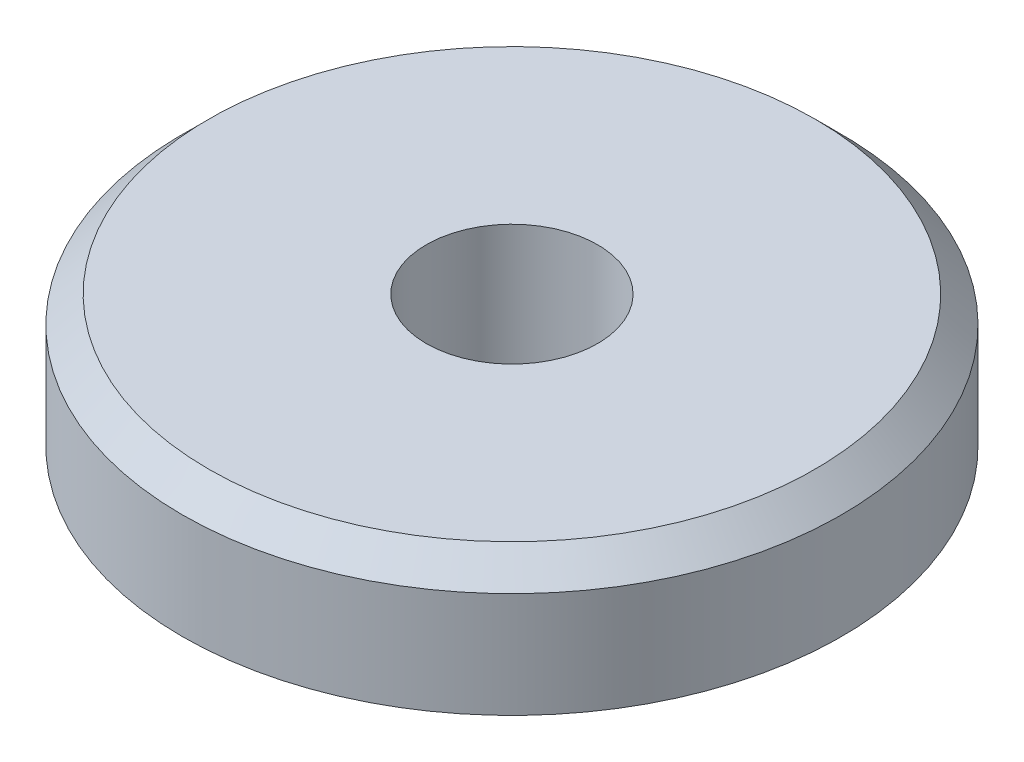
ISO-10303-21;
HEADER;
FILE_DESCRIPTION(('STEP AP214'),'2;1');
FILE_NAME('part.step','',(''),(''),'','','');
FILE_SCHEMA(('AUTOMOTIVE_DESIGN { 1 0 10303 214 1 1 1 1 }'));
ENDSEC;
DATA;
#1=APPLICATION_CONTEXT('core data for automotive mechanical design processes');
#2=APPLICATION_PROTOCOL_DEFINITION('international standard','automotive_design',2000,#1);
#3=PRODUCT_CONTEXT('',#1,'mechanical');
#4=PRODUCT('Part','Part','',(#3));
#5=PRODUCT_RELATED_PRODUCT_CATEGORY('part','',(#4));
#6=PRODUCT_DEFINITION_FORMATION('','',#4);
#7=PRODUCT_DEFINITION_CONTEXT('part definition',#1,'design');
#8=PRODUCT_DEFINITION('design','',#6,#7);
#9=PRODUCT_DEFINITION_SHAPE('','',#8);
#10=(LENGTH_UNIT() NAMED_UNIT(*) SI_UNIT(.MILLI.,.METRE.));
#11=(NAMED_UNIT(*) PLANE_ANGLE_UNIT() SI_UNIT($,.RADIAN.));
#12=(NAMED_UNIT(*) SI_UNIT($,.STERADIAN.) SOLID_ANGLE_UNIT());
#13=UNCERTAINTY_MEASURE_WITH_UNIT(LENGTH_MEASURE(1.E-05),#10,'distance_accuracy_value','');
#14=(GEOMETRIC_REPRESENTATION_CONTEXT(3) GLOBAL_UNCERTAINTY_ASSIGNED_CONTEXT((#13)) GLOBAL_UNIT_ASSIGNED_CONTEXT((#10,
#11,#12)) REPRESENTATION_CONTEXT('',''));
#15=CARTESIAN_POINT('',(0.,0.,0.));
#16=DIRECTION('',(0.,0.,1.));
#17=DIRECTION('',(1.,0.,0.));
#18=AXIS2_PLACEMENT_3D('',#15,#16,#17);
#19=CARTESIAN_POINT('',(0.,5.,0.));
#20=DIRECTION('',(0.,1.,0.));
#21=DIRECTION('',(0.,0.,1.));
#22=AXIS2_PLACEMENT_3D('',#19,#20,#21);
#23=PLANE('',#22);
#24=CARTESIAN_POINT('',(0.,5.,0.));
#25=DIRECTION('',(0.,1.,0.));
#26=DIRECTION('',(0.,0.,1.));
#27=AXIS2_PLACEMENT_3D('',#24,#25,#26);
#28=CIRCLE('',#27,11.5);
#29=CARTESIAN_POINT('',(0.,5.,11.5));
#30=VERTEX_POINT('',#29);
#31=EDGE_CURVE('E37',#30,#30,#28,.T.);
#32=ORIENTED_EDGE('',*,*,#31,.T.);
#33=EDGE_LOOP('',(#32));
#34=FACE_BOUND('',#33,.T.);
#35=CARTESIAN_POINT('',(0.,5.,0.));
#36=DIRECTION('',(0.,1.,0.));
#37=DIRECTION('',(0.,0.,1.));
#38=AXIS2_PLACEMENT_3D('',#35,#36,#37);
#39=CIRCLE('',#38,3.25);
#40=CARTESIAN_POINT('',(0.,5.,3.25));
#41=VERTEX_POINT('',#40);
#42=EDGE_CURVE('E45',#41,#41,#39,.T.);
#43=ORIENTED_EDGE('',*,*,#42,.F.);
#44=EDGE_LOOP('',(#43));
#45=FACE_BOUND('',#44,.T.);
#46=ADVANCED_FACE('F30',(#34,#45),#23,.T.);
#47=CARTESIAN_POINT('',(0.,0.,0.));
#48=DIRECTION('',(0.,1.,0.));
#49=DIRECTION('',(0.,0.,1.));
#50=AXIS2_PLACEMENT_3D('',#47,#48,#49);
#51=PLANE('',#50);
#52=CARTESIAN_POINT('',(0.,0.,0.));
#53=DIRECTION('',(0.,1.,0.));
#54=DIRECTION('',(0.,0.,1.));
#55=AXIS2_PLACEMENT_3D('',#52,#53,#54);
#56=CIRCLE('',#55,12.5);
#57=CARTESIAN_POINT('',(0.,0.,12.5));
#58=VERTEX_POINT('',#57);
#59=EDGE_CURVE('E41',#58,#58,#56,.T.);
#60=ORIENTED_EDGE('',*,*,#59,.F.);
#61=EDGE_LOOP('',(#60));
#62=FACE_BOUND('',#61,.T.);
#63=CARTESIAN_POINT('',(0.,0.,0.));
#64=DIRECTION('',(0.,1.,0.));
#65=DIRECTION('',(0.,0.,1.));
#66=AXIS2_PLACEMENT_3D('',#63,#64,#65);
#67=CIRCLE('',#66,3.25);
#68=CARTESIAN_POINT('',(0.,0.,3.25));
#69=VERTEX_POINT('',#68);
#70=EDGE_CURVE('E48',#69,#69,#67,.T.);
#71=ORIENTED_EDGE('',*,*,#70,.T.);
#72=EDGE_LOOP('',(#71));
#73=FACE_BOUND('',#72,.T.);
#74=ADVANCED_FACE('F58',(#62,#73),#51,.F.);
#75=CARTESIAN_POINT('',(0.,5.,0.));
#76=DIRECTION('',(0.,-1.,0.));
#77=DIRECTION('',(0.,0.,-1.));
#78=AXIS2_PLACEMENT_3D('',#75,#76,#77);
#79=CYLINDRICAL_SURFACE('',#78,12.5);
#80=CARTESIAN_POINT('',(0.,4.,0.));
#81=DIRECTION('',(0.,1.,0.));
#82=DIRECTION('',(0.,0.,1.));
#83=AXIS2_PLACEMENT_3D('',#80,#81,#82);
#84=CIRCLE('',#83,12.5);
#85=CARTESIAN_POINT('',(0.,4.,12.5));
#86=VERTEX_POINT('',#85);
#87=EDGE_CURVE('E10',#86,#86,#84,.F.);
#88=ORIENTED_EDGE('',*,*,#87,.T.);
#89=EDGE_LOOP('',(#88));
#90=FACE_BOUND('',#89,.T.);
#91=ORIENTED_EDGE('',*,*,#59,.T.);
#92=EDGE_LOOP('',(#91));
#93=FACE_BOUND('',#92,.T.);
#94=ADVANCED_FACE('F63',(#90,#93),#79,.T.);
#95=CARTESIAN_POINT('',(0.,5.,0.));
#96=DIRECTION('',(0.,-1.,0.));
#97=DIRECTION('',(0.,0.,-1.));
#98=AXIS2_PLACEMENT_3D('',#95,#96,#97);
#99=CYLINDRICAL_SURFACE('',#98,3.25);
#100=ORIENTED_EDGE('',*,*,#42,.T.);
#101=EDGE_LOOP('',(#100));
#102=FACE_BOUND('',#101,.T.);
#103=ORIENTED_EDGE('',*,*,#70,.F.);
#104=EDGE_LOOP('',(#103));
#105=FACE_BOUND('',#104,.T.);
#106=ADVANCED_FACE('F54',(#102,#105),#99,.F.);
#107=CARTESIAN_POINT('',(0.,5.,0.));
#108=DIRECTION('',(0.,-1.,0.));
#109=DIRECTION('',(0.,0.,-1.));
#110=AXIS2_PLACEMENT_3D('',#107,#108,#109);
#111=CONICAL_SURFACE('',#110,11.5,0.785398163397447);
#112=ORIENTED_EDGE('',*,*,#87,.F.);
#113=EDGE_LOOP('',(#112));
#114=FACE_BOUND('',#113,.T.);
#115=ORIENTED_EDGE('',*,*,#31,.F.);
#116=EDGE_LOOP('',(#115));
#117=FACE_BOUND('',#116,.T.);
#118=ADVANCED_FACE('F32',(#114,#117),#111,.T.);
#119=CLOSED_SHELL('',(#46,#74,#94,#106,#118));
#120=MANIFOLD_SOLID_BREP('B2',#119);
#121=ADVANCED_BREP_SHAPE_REPRESENTATION('',(#18,#120),#14);
#122=SHAPE_DEFINITION_REPRESENTATION(#9,#121);
ENDSEC;
END-ISO-10303-21;
